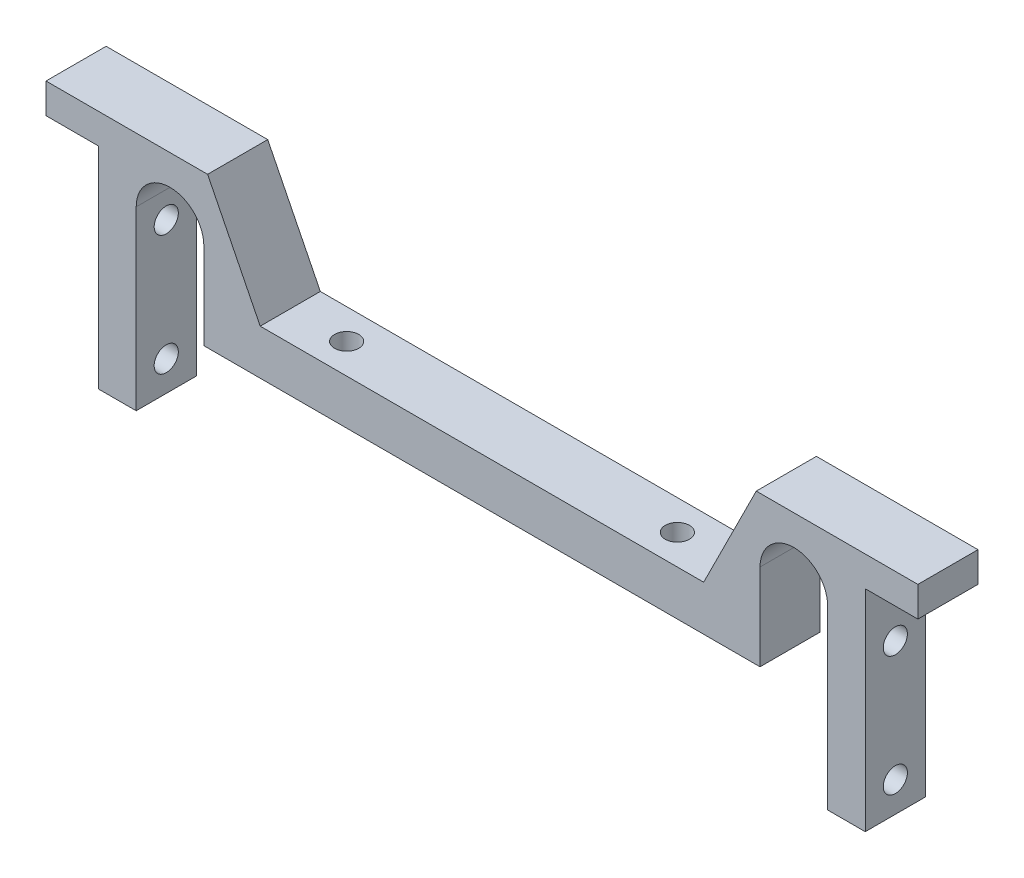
ISO-10303-21;
HEADER;
FILE_DESCRIPTION(('STEP AP214'),'2;1');
FILE_NAME('part.step','',(''),(''),'','','');
FILE_SCHEMA(('AUTOMOTIVE_DESIGN { 1 0 10303 214 1 1 1 1 }'));
ENDSEC;
DATA;
#1=APPLICATION_CONTEXT('core data for automotive mechanical design processes');
#2=APPLICATION_PROTOCOL_DEFINITION('international standard','automotive_design',2000,#1);
#3=PRODUCT_CONTEXT('',#1,'mechanical');
#4=PRODUCT('Part','Part','',(#3));
#5=PRODUCT_RELATED_PRODUCT_CATEGORY('part','',(#4));
#6=PRODUCT_DEFINITION_FORMATION('','',#4);
#7=PRODUCT_DEFINITION_CONTEXT('part definition',#1,'design');
#8=PRODUCT_DEFINITION('design','',#6,#7);
#9=PRODUCT_DEFINITION_SHAPE('','',#8);
#10=(LENGTH_UNIT() NAMED_UNIT(*) SI_UNIT(.MILLI.,.METRE.));
#11=(NAMED_UNIT(*) PLANE_ANGLE_UNIT() SI_UNIT($,.RADIAN.));
#12=(NAMED_UNIT(*) SI_UNIT($,.STERADIAN.) SOLID_ANGLE_UNIT());
#13=UNCERTAINTY_MEASURE_WITH_UNIT(LENGTH_MEASURE(1.E-05),#10,'distance_accuracy_value','');
#14=(GEOMETRIC_REPRESENTATION_CONTEXT(3) GLOBAL_UNCERTAINTY_ASSIGNED_CONTEXT((#13)) GLOBAL_UNIT_ASSIGNED_CONTEXT((#10,
#11,#12)) REPRESENTATION_CONTEXT('',''));
#15=CARTESIAN_POINT('',(0.,0.,0.));
#16=DIRECTION('',(0.,0.,1.));
#17=DIRECTION('',(1.,0.,0.));
#18=AXIS2_PLACEMENT_3D('',#15,#16,#17);
#19=CARTESIAN_POINT('',(-58.7375,0.,6.35));
#20=DIRECTION('',(1.,0.,0.));
#21=DIRECTION('',(0.,1.,0.));
#22=AXIS2_PLACEMENT_3D('',#19,#20,#21);
#23=PLANE('',#22);
#24=DIRECTION('',(0.,-1.,0.));
#25=VECTOR('',#24,1.);
#26=CARTESIAN_POINT('',(-58.7375,0.,-6.35));
#27=LINE('',#26,#25);
#28=CARTESIAN_POINT('',(-58.7375,18.25625,-6.35));
#29=VERTEX_POINT('',#28);
#30=CARTESIAN_POINT('',(-58.7375,0.,-6.35));
#31=VERTEX_POINT('',#30);
#32=EDGE_CURVE('E202',#29,#31,#27,.T.);
#33=ORIENTED_EDGE('',*,*,#32,.T.);
#34=DIRECTION('',(0.,0.,-1.));
#35=VECTOR('',#34,1.);
#36=CARTESIAN_POINT('',(-58.7375,0.,6.35));
#37=LINE('',#36,#35);
#38=CARTESIAN_POINT('',(-58.7375,0.,6.35));
#39=VERTEX_POINT('',#38);
#40=EDGE_CURVE('E11',#39,#31,#37,.T.);
#41=ORIENTED_EDGE('',*,*,#40,.F.);
#42=DIRECTION('',(0.,-1.,0.));
#43=VECTOR('',#42,1.);
#44=CARTESIAN_POINT('',(-58.7375,0.,6.35));
#45=LINE('',#44,#43);
#46=CARTESIAN_POINT('',(-58.7375,18.25625,6.35));
#47=VERTEX_POINT('',#46);
#48=EDGE_CURVE('E241',#47,#39,#45,.T.);
#49=ORIENTED_EDGE('',*,*,#48,.F.);
#50=DIRECTION('',(0.,0.,-1.));
#51=VECTOR('',#50,1.);
#52=CARTESIAN_POINT('',(-58.7375,18.25625,6.35));
#53=LINE('',#52,#51);
#54=EDGE_CURVE('E198',#47,#29,#53,.T.);
#55=ORIENTED_EDGE('',*,*,#54,.T.);
#56=EDGE_LOOP('',(#33,#41,#49,#55));
#57=FACE_BOUND('',#56,.T.);
#58=ADVANCED_FACE('F34',(#57),#23,.F.);
#59=CARTESIAN_POINT('',(-58.7375,0.,6.35));
#60=DIRECTION('',(0.,1.,0.));
#61=DIRECTION('',(-1.,0.,0.));
#62=AXIS2_PLACEMENT_3D('',#59,#60,#61);
#63=PLANE('',#62);
#64=CARTESIAN_POINT('',(-34.925,0.,0.));
#65=DIRECTION('',(0.,1.,0.));
#66=DIRECTION('',(-1.,0.,0.));
#67=AXIS2_PLACEMENT_3D('',#64,#65,#66);
#68=CIRCLE('',#67,2.55269999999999);
#69=CARTESIAN_POINT('',(-37.4777,0.,0.));
#70=VERTEX_POINT('',#69);
#71=EDGE_CURVE('E648',#70,#70,#68,.T.);
#72=ORIENTED_EDGE('',*,*,#71,.T.);
#73=EDGE_LOOP('',(#72));
#74=FACE_BOUND('',#73,.T.);
#75=CARTESIAN_POINT('',(34.925,0.,0.));
#76=DIRECTION('',(0.,1.,0.));
#77=DIRECTION('',(-1.,0.,0.));
#78=AXIS2_PLACEMENT_3D('',#75,#76,#77);
#79=CIRCLE('',#78,2.55269999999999);
#80=CARTESIAN_POINT('',(32.3723,0.,0.));
#81=VERTEX_POINT('',#80);
#82=EDGE_CURVE('E642',#81,#81,#79,.T.);
#83=ORIENTED_EDGE('',*,*,#82,.T.);
#84=EDGE_LOOP('',(#83));
#85=FACE_BOUND('',#84,.T.);
#86=DIRECTION('',(1.,0.,0.));
#87=VECTOR('',#86,1.);
#88=CARTESIAN_POINT('',(-58.7375,0.,-6.35));
#89=LINE('',#88,#87);
#90=CARTESIAN_POINT('',(58.7375,0.,-6.35));
#91=VERTEX_POINT('',#90);
#92=EDGE_CURVE('E205',#31,#91,#89,.T.);
#93=ORIENTED_EDGE('',*,*,#92,.T.);
#94=DIRECTION('',(0.,0.,-1.));
#95=VECTOR('',#94,1.);
#96=CARTESIAN_POINT('',(58.7375,0.,6.35));
#97=LINE('',#96,#95);
#98=CARTESIAN_POINT('',(58.7375,0.,6.35));
#99=VERTEX_POINT('',#98);
#100=EDGE_CURVE('E42',#99,#91,#97,.T.);
#101=ORIENTED_EDGE('',*,*,#100,.F.);
#102=DIRECTION('',(1.,0.,0.));
#103=VECTOR('',#102,1.);
#104=CARTESIAN_POINT('',(-58.7375,0.,6.35));
#105=LINE('',#104,#103);
#106=EDGE_CURVE('E129',#39,#99,#105,.T.);
#107=ORIENTED_EDGE('',*,*,#106,.F.);
#108=ORIENTED_EDGE('',*,*,#40,.T.);
#109=EDGE_LOOP('',(#93,#101,#107,#108));
#110=FACE_BOUND('',#109,.T.);
#111=ADVANCED_FACE('F360',(#74,#85,#110),#63,.F.);
#112=CARTESIAN_POINT('',(58.7375,0.,6.35));
#113=DIRECTION('',(-1.,0.,0.));
#114=DIRECTION('',(0.,-1.,0.));
#115=AXIS2_PLACEMENT_3D('',#112,#113,#114);
#116=PLANE('',#115);
#117=DIRECTION('',(0.,1.,0.));
#118=VECTOR('',#117,1.);
#119=CARTESIAN_POINT('',(58.7375,0.,-6.35));
#120=LINE('',#119,#118);
#121=CARTESIAN_POINT('',(58.7375,18.25625,-6.35));
#122=VERTEX_POINT('',#121);
#123=EDGE_CURVE('E208',#91,#122,#120,.T.);
#124=ORIENTED_EDGE('',*,*,#123,.T.);
#125=DIRECTION('',(0.,0.,-1.));
#126=VECTOR('',#125,1.);
#127=CARTESIAN_POINT('',(58.7375,18.25625,6.35));
#128=LINE('',#127,#126);
#129=CARTESIAN_POINT('',(58.7375,18.25625,6.35));
#130=VERTEX_POINT('',#129);
#131=EDGE_CURVE('E284',#130,#122,#128,.T.);
#132=ORIENTED_EDGE('',*,*,#131,.F.);
#133=DIRECTION('',(0.,1.,0.));
#134=VECTOR('',#133,1.);
#135=CARTESIAN_POINT('',(58.7375,0.,6.35));
#136=LINE('',#135,#134);
#137=EDGE_CURVE('E292',#99,#130,#136,.T.);
#138=ORIENTED_EDGE('',*,*,#137,.F.);
#139=ORIENTED_EDGE('',*,*,#100,.T.);
#140=EDGE_LOOP('',(#124,#132,#138,#139));
#141=FACE_BOUND('',#140,.T.);
#142=ADVANCED_FACE('F290',(#141),#116,.F.);
#143=CARTESIAN_POINT('',(65.88125,18.25625,6.35));
#144=DIRECTION('',(0.,0.,-1.));
#145=DIRECTION('',(-1.,0.,0.));
#146=AXIS2_PLACEMENT_3D('',#143,#144,#145);
#147=CYLINDRICAL_SURFACE('',#146,7.14375);
#148=CARTESIAN_POINT('',(65.88125,18.25625,-6.35));
#149=DIRECTION('',(0.,0.,-1.));
#150=DIRECTION('',(-1.,0.,0.));
#151=AXIS2_PLACEMENT_3D('',#148,#149,#150);
#152=CIRCLE('',#151,7.14375);
#153=CARTESIAN_POINT('',(73.025,18.25625,-6.35));
#154=VERTEX_POINT('',#153);
#155=EDGE_CURVE('E210',#122,#154,#152,.T.);
#156=ORIENTED_EDGE('',*,*,#155,.T.);
#157=DIRECTION('',(0.,0.,-1.));
#158=VECTOR('',#157,1.);
#159=CARTESIAN_POINT('',(73.025,18.25625,6.35));
#160=LINE('',#159,#158);
#161=CARTESIAN_POINT('',(73.025,18.25625,6.35));
#162=VERTEX_POINT('',#161);
#163=EDGE_CURVE('E281',#162,#154,#160,.T.);
#164=ORIENTED_EDGE('',*,*,#163,.F.);
#165=CARTESIAN_POINT('',(65.88125,18.25625,6.35));
#166=DIRECTION('',(0.,0.,-1.));
#167=DIRECTION('',(-1.,0.,0.));
#168=AXIS2_PLACEMENT_3D('',#165,#166,#167);
#169=CIRCLE('',#168,7.14375);
#170=EDGE_CURVE('E310',#130,#162,#169,.T.);
#171=ORIENTED_EDGE('',*,*,#170,.F.);
#172=ORIENTED_EDGE('',*,*,#131,.T.);
#173=EDGE_LOOP('',(#156,#164,#171,#172));
#174=FACE_BOUND('',#173,.T.);
#175=ADVANCED_FACE('F301',(#174),#147,.F.);
#176=CARTESIAN_POINT('',(73.025,18.25625,6.35));
#177=DIRECTION('',(1.,0.,0.));
#178=DIRECTION('',(0.,0.,-1.));
#179=AXIS2_PLACEMENT_3D('',#176,#177,#178);
#180=PLANE('',#179);
#181=CARTESIAN_POINT('',(73.025,12.7000000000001,0.));
#182=DIRECTION('',(1.,0.,0.));
#183=DIRECTION('',(0.,0.,-1.));
#184=AXIS2_PLACEMENT_3D('',#181,#182,#183);
#185=CIRCLE('',#184,2.55269999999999);
#186=CARTESIAN_POINT('',(73.025,12.7000000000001,-2.55269999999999));
#187=VERTEX_POINT('',#186);
#188=EDGE_CURVE('E619',#187,#187,#185,.T.);
#189=ORIENTED_EDGE('',*,*,#188,.T.);
#190=EDGE_LOOP('',(#189));
#191=FACE_BOUND('',#190,.T.);
#192=CARTESIAN_POINT('',(73.025,-12.6999999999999,0.));
#193=DIRECTION('',(1.,0.,0.));
#194=DIRECTION('',(0.,0.,-1.));
#195=AXIS2_PLACEMENT_3D('',#192,#193,#194);
#196=CIRCLE('',#195,2.55269999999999);
#197=CARTESIAN_POINT('',(73.025,-12.6999999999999,-2.55269999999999));
#198=VERTEX_POINT('',#197);
#199=EDGE_CURVE('E206',#198,#198,#196,.T.);
#200=ORIENTED_EDGE('',*,*,#199,.T.);
#201=EDGE_LOOP('',(#200));
#202=FACE_BOUND('',#201,.T.);
#203=DIRECTION('',(0.,-1.,0.));
#204=VECTOR('',#203,1.);
#205=CARTESIAN_POINT('',(73.025,18.25625,-6.35));
#206=LINE('',#205,#204);
#207=CARTESIAN_POINT('',(73.025,-19.05,-6.35));
#208=VERTEX_POINT('',#207);
#209=EDGE_CURVE('E212',#154,#208,#206,.T.);
#210=ORIENTED_EDGE('',*,*,#209,.T.);
#211=DIRECTION('',(0.,0.,-1.));
#212=VECTOR('',#211,1.);
#213=CARTESIAN_POINT('',(73.025,-19.05,6.35));
#214=LINE('',#213,#212);
#215=CARTESIAN_POINT('',(73.025,-19.05,6.35));
#216=VERTEX_POINT('',#215);
#217=EDGE_CURVE('E278',#216,#208,#214,.T.);
#218=ORIENTED_EDGE('',*,*,#217,.F.);
#219=DIRECTION('',(0.,-1.,0.));
#220=VECTOR('',#219,1.);
#221=CARTESIAN_POINT('',(73.025,18.25625,6.35));
#222=LINE('',#221,#220);
#223=EDGE_CURVE('E307',#162,#216,#222,.T.);
#224=ORIENTED_EDGE('',*,*,#223,.F.);
#225=ORIENTED_EDGE('',*,*,#163,.T.);
#226=EDGE_LOOP('',(#210,#218,#224,#225));
#227=FACE_BOUND('',#226,.T.);
#228=ADVANCED_FACE('F305',(#191,#202,#227),#180,.F.);
#229=CARTESIAN_POINT('',(73.025,-19.05,6.35));
#230=DIRECTION('',(0.,1.,0.));
#231=DIRECTION('',(0.,0.,1.));
#232=AXIS2_PLACEMENT_3D('',#229,#230,#231);
#233=PLANE('',#232);
#234=DIRECTION('',(1.,0.,0.));
#235=VECTOR('',#234,1.);
#236=CARTESIAN_POINT('',(73.025,-19.05,-6.35));
#237=LINE('',#236,#235);
#238=CARTESIAN_POINT('',(80.9625,-19.05,-6.35));
#239=VERTEX_POINT('',#238);
#240=EDGE_CURVE('E214',#208,#239,#237,.T.);
#241=ORIENTED_EDGE('',*,*,#240,.T.);
#242=DIRECTION('',(0.,0.,-1.));
#243=VECTOR('',#242,1.);
#244=CARTESIAN_POINT('',(80.9625,-19.05,6.35));
#245=LINE('',#244,#243);
#246=CARTESIAN_POINT('',(80.9625,-19.05,6.35));
#247=VERTEX_POINT('',#246);
#248=EDGE_CURVE('E275',#247,#239,#245,.T.);
#249=ORIENTED_EDGE('',*,*,#248,.F.);
#250=DIRECTION('',(1.,0.,0.));
#251=VECTOR('',#250,1.);
#252=CARTESIAN_POINT('',(73.025,-19.05,6.35));
#253=LINE('',#252,#251);
#254=EDGE_CURVE('E309',#216,#247,#253,.T.);
#255=ORIENTED_EDGE('',*,*,#254,.F.);
#256=ORIENTED_EDGE('',*,*,#217,.T.);
#257=EDGE_LOOP('',(#241,#249,#255,#256));
#258=FACE_BOUND('',#257,.T.);
#259=ADVANCED_FACE('F376',(#258),#233,.F.);
#260=CARTESIAN_POINT('',(80.9625,-19.05,6.35));
#261=DIRECTION('',(-1.,0.,0.));
#262=DIRECTION('',(0.,-1.,0.));
#263=AXIS2_PLACEMENT_3D('',#260,#261,#262);
#264=PLANE('',#263);
#265=CARTESIAN_POINT('',(80.9625,12.7000000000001,0.));
#266=DIRECTION('',(1.,0.,0.));
#267=DIRECTION('',(0.,0.,-1.));
#268=AXIS2_PLACEMENT_3D('',#265,#266,#267);
#269=CIRCLE('',#268,2.55269999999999);
#270=CARTESIAN_POINT('',(80.9625,12.7000000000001,-2.55269999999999));
#271=VERTEX_POINT('',#270);
#272=EDGE_CURVE('E623',#271,#271,#269,.T.);
#273=ORIENTED_EDGE('',*,*,#272,.F.);
#274=EDGE_LOOP('',(#273));
#275=FACE_BOUND('',#274,.T.);
#276=CARTESIAN_POINT('',(80.9625,-12.6999999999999,0.));
#277=DIRECTION('',(1.,0.,0.));
#278=DIRECTION('',(0.,0.,-1.));
#279=AXIS2_PLACEMENT_3D('',#276,#277,#278);
#280=CIRCLE('',#279,2.55269999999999);
#281=CARTESIAN_POINT('',(80.9625,-12.6999999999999,-2.55269999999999));
#282=VERTEX_POINT('',#281);
#283=EDGE_CURVE('E617',#282,#282,#280,.T.);
#284=ORIENTED_EDGE('',*,*,#283,.F.);
#285=EDGE_LOOP('',(#284));
#286=FACE_BOUND('',#285,.T.);
#287=DIRECTION('',(0.,1.,0.));
#288=VECTOR('',#287,1.);
#289=CARTESIAN_POINT('',(80.9625,-19.05,-6.35));
#290=LINE('',#289,#288);
#291=CARTESIAN_POINT('',(80.9625,25.4,-6.35));
#292=VERTEX_POINT('',#291);
#293=EDGE_CURVE('E216',#239,#292,#290,.T.);
#294=ORIENTED_EDGE('',*,*,#293,.T.);
#295=DIRECTION('',(0.,0.,-1.));
#296=VECTOR('',#295,1.);
#297=CARTESIAN_POINT('',(80.9625,25.4,6.35));
#298=LINE('',#297,#296);
#299=CARTESIAN_POINT('',(80.9625,25.4,6.35));
#300=VERTEX_POINT('',#299);
#301=EDGE_CURVE('E272',#300,#292,#298,.T.);
#302=ORIENTED_EDGE('',*,*,#301,.F.);
#303=DIRECTION('',(0.,1.,0.));
#304=VECTOR('',#303,1.);
#305=CARTESIAN_POINT('',(80.9625,-19.05,6.35));
#306=LINE('',#305,#304);
#307=EDGE_CURVE('E312',#247,#300,#306,.T.);
#308=ORIENTED_EDGE('',*,*,#307,.F.);
#309=ORIENTED_EDGE('',*,*,#248,.T.);
#310=EDGE_LOOP('',(#294,#302,#308,#309));
#311=FACE_BOUND('',#310,.T.);
#312=ADVANCED_FACE('F380',(#275,#286,#311),#264,.F.);
#313=CARTESIAN_POINT('',(80.9625,25.4,6.35));
#314=DIRECTION('',(0.,1.,0.));
#315=DIRECTION('',(0.,0.,1.));
#316=AXIS2_PLACEMENT_3D('',#313,#314,#315);
#317=PLANE('',#316);
#318=DIRECTION('',(1.,0.,0.));
#319=VECTOR('',#318,1.);
#320=CARTESIAN_POINT('',(80.9625,25.4,-6.35));
#321=LINE('',#320,#319);
#322=CARTESIAN_POINT('',(92.075,25.4,-6.35));
#323=VERTEX_POINT('',#322);
#324=EDGE_CURVE('E218',#292,#323,#321,.T.);
#325=ORIENTED_EDGE('',*,*,#324,.T.);
#326=DIRECTION('',(0.,0.,-1.));
#327=VECTOR('',#326,1.);
#328=CARTESIAN_POINT('',(92.075,25.4,6.35));
#329=LINE('',#328,#327);
#330=CARTESIAN_POINT('',(92.075,25.4,6.35));
#331=VERTEX_POINT('',#330);
#332=EDGE_CURVE('E269',#331,#323,#329,.T.);
#333=ORIENTED_EDGE('',*,*,#332,.F.);
#334=DIRECTION('',(1.,0.,0.));
#335=VECTOR('',#334,1.);
#336=CARTESIAN_POINT('',(80.9625,25.4,6.35));
#337=LINE('',#336,#335);
#338=EDGE_CURVE('E318',#300,#331,#337,.T.);
#339=ORIENTED_EDGE('',*,*,#338,.F.);
#340=ORIENTED_EDGE('',*,*,#301,.T.);
#341=EDGE_LOOP('',(#325,#333,#339,#340));
#342=FACE_BOUND('',#341,.T.);
#343=ADVANCED_FACE('F384',(#342),#317,.F.);
#344=CARTESIAN_POINT('',(92.075,25.4,6.35));
#345=DIRECTION('',(-1.,0.,0.));
#346=DIRECTION('',(0.,-1.,0.));
#347=AXIS2_PLACEMENT_3D('',#344,#345,#346);
#348=PLANE('',#347);
#349=DIRECTION('',(0.,1.,0.));
#350=VECTOR('',#349,1.);
#351=CARTESIAN_POINT('',(92.075,25.4,-6.35));
#352=LINE('',#351,#350);
#353=CARTESIAN_POINT('',(92.075,31.75,-6.35));
#354=VERTEX_POINT('',#353);
#355=EDGE_CURVE('E220',#323,#354,#352,.T.);
#356=ORIENTED_EDGE('',*,*,#355,.T.);
#357=DIRECTION('',(0.,0.,-1.));
#358=VECTOR('',#357,1.);
#359=CARTESIAN_POINT('',(92.075,31.75,6.35));
#360=LINE('',#359,#358);
#361=CARTESIAN_POINT('',(92.075,31.75,6.35));
#362=VERTEX_POINT('',#361);
#363=EDGE_CURVE('E266',#362,#354,#360,.T.);
#364=ORIENTED_EDGE('',*,*,#363,.F.);
#365=DIRECTION('',(0.,1.,0.));
#366=VECTOR('',#365,1.);
#367=CARTESIAN_POINT('',(92.075,25.4,6.35));
#368=LINE('',#367,#366);
#369=EDGE_CURVE('E320',#331,#362,#368,.T.);
#370=ORIENTED_EDGE('',*,*,#369,.F.);
#371=ORIENTED_EDGE('',*,*,#332,.T.);
#372=EDGE_LOOP('',(#356,#364,#370,#371));
#373=FACE_BOUND('',#372,.T.);
#374=ADVANCED_FACE('F388',(#373),#348,.F.);
#375=CARTESIAN_POINT('',(57.94375,31.75,6.35));
#376=DIRECTION('',(0.,-1.,0.));
#377=DIRECTION('',(1.,0.,0.));
#378=AXIS2_PLACEMENT_3D('',#375,#376,#377);
#379=PLANE('',#378);
#380=DIRECTION('',(-1.,0.,0.));
#381=VECTOR('',#380,1.);
#382=CARTESIAN_POINT('',(57.94375,31.75,-6.35));
#383=LINE('',#382,#381);
#384=CARTESIAN_POINT('',(57.94375,31.75,-6.35));
#385=VERTEX_POINT('',#384);
#386=EDGE_CURVE('E222',#354,#385,#383,.T.);
#387=ORIENTED_EDGE('',*,*,#386,.T.);
#388=DIRECTION('',(0.,0.,-1.));
#389=VECTOR('',#388,1.);
#390=CARTESIAN_POINT('',(57.94375,31.75,6.35));
#391=LINE('',#390,#389);
#392=CARTESIAN_POINT('',(57.94375,31.75,6.35));
#393=VERTEX_POINT('',#392);
#394=EDGE_CURVE('E263',#393,#385,#391,.T.);
#395=ORIENTED_EDGE('',*,*,#394,.F.);
#396=DIRECTION('',(-1.,0.,0.));
#397=VECTOR('',#396,1.);
#398=CARTESIAN_POINT('',(57.94375,31.75,6.35));
#399=LINE('',#398,#397);
#400=EDGE_CURVE('E322',#362,#393,#399,.T.);
#401=ORIENTED_EDGE('',*,*,#400,.F.);
#402=ORIENTED_EDGE('',*,*,#363,.T.);
#403=EDGE_LOOP('',(#387,#395,#401,#402));
#404=FACE_BOUND('',#403,.T.);
#405=ADVANCED_FACE('F392',(#404),#379,.F.);
#406=CARTESIAN_POINT('',(46.83125,9.52500000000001,6.35));
#407=DIRECTION('',(0.894427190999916,-0.447213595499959,0.));
#408=DIRECTION('',(0.447213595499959,0.894427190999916,0.));
#409=AXIS2_PLACEMENT_3D('',#406,#407,#408);
#410=PLANE('',#409);
#411=DIRECTION('',(-0.447213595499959,-0.894427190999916,0.));
#412=VECTOR('',#411,1.);
#413=CARTESIAN_POINT('',(46.83125,9.52500000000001,-6.35));
#414=LINE('',#413,#412);
#415=CARTESIAN_POINT('',(46.83125,9.52500000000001,-6.35));
#416=VERTEX_POINT('',#415);
#417=EDGE_CURVE('E224',#385,#416,#414,.T.);
#418=ORIENTED_EDGE('',*,*,#417,.T.);
#419=DIRECTION('',(0.,0.,-1.));
#420=VECTOR('',#419,1.);
#421=CARTESIAN_POINT('',(46.83125,9.52500000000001,6.35));
#422=LINE('',#421,#420);
#423=CARTESIAN_POINT('',(46.83125,9.52500000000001,6.35));
#424=VERTEX_POINT('',#423);
#425=EDGE_CURVE('E260',#424,#416,#422,.T.);
#426=ORIENTED_EDGE('',*,*,#425,.F.);
#427=DIRECTION('',(-0.447213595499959,-0.894427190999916,0.));
#428=VECTOR('',#427,1.);
#429=CARTESIAN_POINT('',(46.83125,9.52500000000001,6.35));
#430=LINE('',#429,#428);
#431=EDGE_CURVE('E324',#393,#424,#430,.T.);
#432=ORIENTED_EDGE('',*,*,#431,.F.);
#433=ORIENTED_EDGE('',*,*,#394,.T.);
#434=EDGE_LOOP('',(#418,#426,#432,#433));
#435=FACE_BOUND('',#434,.T.);
#436=ADVANCED_FACE('F396',(#435),#410,.F.);
#437=CARTESIAN_POINT('',(-46.83125,9.525,6.35));
#438=DIRECTION('',(0.,-1.,0.));
#439=DIRECTION('',(1.,0.,0.));
#440=AXIS2_PLACEMENT_3D('',#437,#438,#439);
#441=PLANE('',#440);
#442=CARTESIAN_POINT('',(-34.925,9.52500000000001,0.));
#443=DIRECTION('',(0.,1.,0.));
#444=DIRECTION('',(0.,0.,1.));
#445=AXIS2_PLACEMENT_3D('',#442,#443,#444);
#446=CIRCLE('',#445,2.55269999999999);
#447=CARTESIAN_POINT('',(-34.925,9.52500000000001,2.55269999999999));
#448=VERTEX_POINT('',#447);
#449=EDGE_CURVE('E650',#448,#448,#446,.T.);
#450=ORIENTED_EDGE('',*,*,#449,.F.);
#451=EDGE_LOOP('',(#450));
#452=FACE_BOUND('',#451,.T.);
#453=CARTESIAN_POINT('',(34.925,9.52500000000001,0.));
#454=DIRECTION('',(0.,1.,0.));
#455=DIRECTION('',(0.,0.,1.));
#456=AXIS2_PLACEMENT_3D('',#453,#454,#455);
#457=CIRCLE('',#456,2.55269999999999);
#458=CARTESIAN_POINT('',(34.925,9.52500000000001,2.55269999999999));
#459=VERTEX_POINT('',#458);
#460=EDGE_CURVE('E645',#459,#459,#457,.T.);
#461=ORIENTED_EDGE('',*,*,#460,.F.);
#462=EDGE_LOOP('',(#461));
#463=FACE_BOUND('',#462,.T.);
#464=DIRECTION('',(-1.,0.,0.));
#465=VECTOR('',#464,1.);
#466=CARTESIAN_POINT('',(-46.83125,9.525,-6.35));
#467=LINE('',#466,#465);
#468=CARTESIAN_POINT('',(-46.83125,9.525,-6.35));
#469=VERTEX_POINT('',#468);
#470=EDGE_CURVE('E226',#416,#469,#467,.T.);
#471=ORIENTED_EDGE('',*,*,#470,.T.);
#472=DIRECTION('',(0.,0.,-1.));
#473=VECTOR('',#472,1.);
#474=CARTESIAN_POINT('',(-46.83125,9.525,6.35));
#475=LINE('',#474,#473);
#476=CARTESIAN_POINT('',(-46.83125,9.525,6.35));
#477=VERTEX_POINT('',#476);
#478=EDGE_CURVE('E257',#477,#469,#475,.T.);
#479=ORIENTED_EDGE('',*,*,#478,.F.);
#480=DIRECTION('',(-1.,0.,0.));
#481=VECTOR('',#480,1.);
#482=CARTESIAN_POINT('',(-46.83125,9.525,6.35));
#483=LINE('',#482,#481);
#484=EDGE_CURVE('E326',#424,#477,#483,.T.);
#485=ORIENTED_EDGE('',*,*,#484,.F.);
#486=ORIENTED_EDGE('',*,*,#425,.T.);
#487=EDGE_LOOP('',(#471,#479,#485,#486));
#488=FACE_BOUND('',#487,.T.);
#489=ADVANCED_FACE('F400',(#452,#463,#488),#441,.F.);
#490=CARTESIAN_POINT('',(-57.94375,31.75,6.35));
#491=DIRECTION('',(-0.894427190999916,-0.447213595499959,0.));
#492=DIRECTION('',(0.447213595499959,-0.894427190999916,0.));
#493=AXIS2_PLACEMENT_3D('',#490,#491,#492);
#494=PLANE('',#493);
#495=DIRECTION('',(-0.447213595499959,0.894427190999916,0.));
#496=VECTOR('',#495,1.);
#497=CARTESIAN_POINT('',(-57.94375,31.75,-6.35));
#498=LINE('',#497,#496);
#499=CARTESIAN_POINT('',(-57.94375,31.75,-6.35));
#500=VERTEX_POINT('',#499);
#501=EDGE_CURVE('E228',#469,#500,#498,.T.);
#502=ORIENTED_EDGE('',*,*,#501,.T.);
#503=DIRECTION('',(0.,0.,-1.));
#504=VECTOR('',#503,1.);
#505=CARTESIAN_POINT('',(-57.94375,31.75,6.35));
#506=LINE('',#505,#504);
#507=CARTESIAN_POINT('',(-57.94375,31.75,6.35));
#508=VERTEX_POINT('',#507);
#509=EDGE_CURVE('E254',#508,#500,#506,.T.);
#510=ORIENTED_EDGE('',*,*,#509,.F.);
#511=DIRECTION('',(-0.447213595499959,0.894427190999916,0.));
#512=VECTOR('',#511,1.);
#513=CARTESIAN_POINT('',(-57.94375,31.75,6.35));
#514=LINE('',#513,#512);
#515=EDGE_CURVE('E328',#477,#508,#514,.T.);
#516=ORIENTED_EDGE('',*,*,#515,.F.);
#517=ORIENTED_EDGE('',*,*,#478,.T.);
#518=EDGE_LOOP('',(#502,#510,#516,#517));
#519=FACE_BOUND('',#518,.T.);
#520=ADVANCED_FACE('F404',(#519),#494,.F.);
#521=CARTESIAN_POINT('',(-92.075,31.75,6.35));
#522=DIRECTION('',(0.,-1.,0.));
#523=DIRECTION('',(0.,0.,-1.));
#524=AXIS2_PLACEMENT_3D('',#521,#522,#523);
#525=PLANE('',#524);
#526=DIRECTION('',(-1.,0.,0.));
#527=VECTOR('',#526,1.);
#528=CARTESIAN_POINT('',(-92.075,31.75,-6.35));
#529=LINE('',#528,#527);
#530=CARTESIAN_POINT('',(-92.075,31.75,-6.35));
#531=VERTEX_POINT('',#530);
#532=EDGE_CURVE('E230',#500,#531,#529,.T.);
#533=ORIENTED_EDGE('',*,*,#532,.T.);
#534=DIRECTION('',(0.,0.,-1.));
#535=VECTOR('',#534,1.);
#536=CARTESIAN_POINT('',(-92.075,31.75,6.35));
#537=LINE('',#536,#535);
#538=CARTESIAN_POINT('',(-92.075,31.75,6.35));
#539=VERTEX_POINT('',#538);
#540=EDGE_CURVE('E251',#539,#531,#537,.T.);
#541=ORIENTED_EDGE('',*,*,#540,.F.);
#542=DIRECTION('',(-1.,0.,0.));
#543=VECTOR('',#542,1.);
#544=CARTESIAN_POINT('',(-92.075,31.75,6.35));
#545=LINE('',#544,#543);
#546=EDGE_CURVE('E330',#508,#539,#545,.T.);
#547=ORIENTED_EDGE('',*,*,#546,.F.);
#548=ORIENTED_EDGE('',*,*,#509,.T.);
#549=EDGE_LOOP('',(#533,#541,#547,#548));
#550=FACE_BOUND('',#549,.T.);
#551=ADVANCED_FACE('F408',(#550),#525,.F.);
#552=CARTESIAN_POINT('',(-92.075,25.4,6.35));
#553=DIRECTION('',(1.,0.,0.));
#554=DIRECTION('',(0.,0.,-1.));
#555=AXIS2_PLACEMENT_3D('',#552,#553,#554);
#556=PLANE('',#555);
#557=DIRECTION('',(0.,-1.,0.));
#558=VECTOR('',#557,1.);
#559=CARTESIAN_POINT('',(-92.075,25.4,-6.35));
#560=LINE('',#559,#558);
#561=CARTESIAN_POINT('',(-92.075,25.4,-6.35));
#562=VERTEX_POINT('',#561);
#563=EDGE_CURVE('E232',#531,#562,#560,.T.);
#564=ORIENTED_EDGE('',*,*,#563,.T.);
#565=DIRECTION('',(0.,0.,-1.));
#566=VECTOR('',#565,1.);
#567=CARTESIAN_POINT('',(-92.075,25.4,6.35));
#568=LINE('',#567,#566);
#569=CARTESIAN_POINT('',(-92.075,25.4,6.35));
#570=VERTEX_POINT('',#569);
#571=EDGE_CURVE('E248',#570,#562,#568,.T.);
#572=ORIENTED_EDGE('',*,*,#571,.F.);
#573=DIRECTION('',(0.,-1.,0.));
#574=VECTOR('',#573,1.);
#575=CARTESIAN_POINT('',(-92.075,25.4,6.35));
#576=LINE('',#575,#574);
#577=EDGE_CURVE('E332',#539,#570,#576,.T.);
#578=ORIENTED_EDGE('',*,*,#577,.F.);
#579=ORIENTED_EDGE('',*,*,#540,.T.);
#580=EDGE_LOOP('',(#564,#572,#578,#579));
#581=FACE_BOUND('',#580,.T.);
#582=ADVANCED_FACE('F412',(#581),#556,.F.);
#583=CARTESIAN_POINT('',(-92.075,25.4,6.35));
#584=DIRECTION('',(0.,1.,0.));
#585=DIRECTION('',(0.,0.,1.));
#586=AXIS2_PLACEMENT_3D('',#583,#584,#585);
#587=PLANE('',#586);
#588=DIRECTION('',(1.,0.,0.));
#589=VECTOR('',#588,1.);
#590=CARTESIAN_POINT('',(-92.075,25.4,-6.35));
#591=LINE('',#590,#589);
#592=CARTESIAN_POINT('',(-80.9625,25.4,-6.35));
#593=VERTEX_POINT('',#592);
#594=EDGE_CURVE('E234',#562,#593,#591,.T.);
#595=ORIENTED_EDGE('',*,*,#594,.T.);
#596=DIRECTION('',(0.,0.,-1.));
#597=VECTOR('',#596,1.);
#598=CARTESIAN_POINT('',(-80.9625,25.4,6.35));
#599=LINE('',#598,#597);
#600=CARTESIAN_POINT('',(-80.9625,25.4,6.35));
#601=VERTEX_POINT('',#600);
#602=EDGE_CURVE('E245',#601,#593,#599,.T.);
#603=ORIENTED_EDGE('',*,*,#602,.F.);
#604=DIRECTION('',(1.,0.,0.));
#605=VECTOR('',#604,1.);
#606=CARTESIAN_POINT('',(-92.075,25.4,6.35));
#607=LINE('',#606,#605);
#608=EDGE_CURVE('E334',#570,#601,#607,.T.);
#609=ORIENTED_EDGE('',*,*,#608,.F.);
#610=ORIENTED_EDGE('',*,*,#571,.T.);
#611=EDGE_LOOP('',(#595,#603,#609,#610));
#612=FACE_BOUND('',#611,.T.);
#613=ADVANCED_FACE('F340',(#612),#587,.F.);
#614=CARTESIAN_POINT('',(-80.9625,-19.05,6.35));
#615=DIRECTION('',(1.,0.,0.));
#616=DIRECTION('',(0.,1.,0.));
#617=AXIS2_PLACEMENT_3D('',#614,#615,#616);
#618=PLANE('',#617);
#619=CARTESIAN_POINT('',(-80.9625,12.7000000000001,0.));
#620=DIRECTION('',(-1.,0.,0.));
#621=DIRECTION('',(0.,0.,1.));
#622=AXIS2_PLACEMENT_3D('',#619,#620,#621);
#623=CIRCLE('',#622,2.55269999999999);
#624=CARTESIAN_POINT('',(-80.9625,12.7000000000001,2.55269999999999));
#625=VERTEX_POINT('',#624);
#626=EDGE_CURVE('E639',#625,#625,#623,.T.);
#627=ORIENTED_EDGE('',*,*,#626,.F.);
#628=EDGE_LOOP('',(#627));
#629=FACE_BOUND('',#628,.T.);
#630=CARTESIAN_POINT('',(-80.9625,-12.6999999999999,0.));
#631=DIRECTION('',(-1.,0.,0.));
#632=DIRECTION('',(0.,0.,1.));
#633=AXIS2_PLACEMENT_3D('',#630,#631,#632);
#634=CIRCLE('',#633,2.55269999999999);
#635=CARTESIAN_POINT('',(-80.9625,-12.6999999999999,2.55269999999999));
#636=VERTEX_POINT('',#635);
#637=EDGE_CURVE('E633',#636,#636,#634,.T.);
#638=ORIENTED_EDGE('',*,*,#637,.F.);
#639=EDGE_LOOP('',(#638));
#640=FACE_BOUND('',#639,.T.);
#641=DIRECTION('',(0.,-1.,0.));
#642=VECTOR('',#641,1.);
#643=CARTESIAN_POINT('',(-80.9625,-19.05,-6.35));
#644=LINE('',#643,#642);
#645=CARTESIAN_POINT('',(-80.9625,-19.05,-6.35));
#646=VERTEX_POINT('',#645);
#647=EDGE_CURVE('E236',#593,#646,#644,.T.);
#648=ORIENTED_EDGE('',*,*,#647,.T.);
#649=DIRECTION('',(0.,0.,-1.));
#650=VECTOR('',#649,1.);
#651=CARTESIAN_POINT('',(-80.9625,-19.05,6.35));
#652=LINE('',#651,#650);
#653=CARTESIAN_POINT('',(-80.9625,-19.05,6.35));
#654=VERTEX_POINT('',#653);
#655=EDGE_CURVE('E193',#654,#646,#652,.T.);
#656=ORIENTED_EDGE('',*,*,#655,.F.);
#657=DIRECTION('',(0.,-1.,0.));
#658=VECTOR('',#657,1.);
#659=CARTESIAN_POINT('',(-80.9625,-19.05,6.35));
#660=LINE('',#659,#658);
#661=EDGE_CURVE('E184',#601,#654,#660,.T.);
#662=ORIENTED_EDGE('',*,*,#661,.F.);
#663=ORIENTED_EDGE('',*,*,#602,.T.);
#664=EDGE_LOOP('',(#648,#656,#662,#663));
#665=FACE_BOUND('',#664,.T.);
#666=ADVANCED_FACE('F344',(#629,#640,#665),#618,.F.);
#667=CARTESIAN_POINT('',(-73.025,-19.05,6.35));
#668=DIRECTION('',(0.,1.,0.));
#669=DIRECTION('',(-1.,0.,0.));
#670=AXIS2_PLACEMENT_3D('',#667,#668,#669);
#671=PLANE('',#670);
#672=DIRECTION('',(1.,0.,0.));
#673=VECTOR('',#672,1.);
#674=CARTESIAN_POINT('',(-73.025,-19.05,-6.35));
#675=LINE('',#674,#673);
#676=CARTESIAN_POINT('',(-73.025,-19.05,-6.35));
#677=VERTEX_POINT('',#676);
#678=EDGE_CURVE('E192',#646,#677,#675,.T.);
#679=ORIENTED_EDGE('',*,*,#678,.T.);
#680=DIRECTION('',(0.,0.,-1.));
#681=VECTOR('',#680,1.);
#682=CARTESIAN_POINT('',(-73.025,-19.05,6.35));
#683=LINE('',#682,#681);
#684=CARTESIAN_POINT('',(-73.025,-19.05,6.35));
#685=VERTEX_POINT('',#684);
#686=EDGE_CURVE('E189',#685,#677,#683,.T.);
#687=ORIENTED_EDGE('',*,*,#686,.F.);
#688=DIRECTION('',(1.,0.,0.));
#689=VECTOR('',#688,1.);
#690=CARTESIAN_POINT('',(-73.025,-19.05,6.35));
#691=LINE('',#690,#689);
#692=EDGE_CURVE('E178',#654,#685,#691,.T.);
#693=ORIENTED_EDGE('',*,*,#692,.F.);
#694=ORIENTED_EDGE('',*,*,#655,.T.);
#695=EDGE_LOOP('',(#679,#687,#693,#694));
#696=FACE_BOUND('',#695,.T.);
#697=ADVANCED_FACE('F190',(#696),#671,.F.);
#698=CARTESIAN_POINT('',(-73.025,18.25625,6.35));
#699=DIRECTION('',(-1.,0.,0.));
#700=DIRECTION('',(0.,0.,1.));
#701=AXIS2_PLACEMENT_3D('',#698,#699,#700);
#702=PLANE('',#701);
#703=CARTESIAN_POINT('',(-73.025,12.7000000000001,0.));
#704=DIRECTION('',(-1.,0.,0.));
#705=DIRECTION('',(0.,0.,1.));
#706=AXIS2_PLACEMENT_3D('',#703,#704,#705);
#707=CIRCLE('',#706,2.55269999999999);
#708=CARTESIAN_POINT('',(-73.025,12.7000000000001,2.55269999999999));
#709=VERTEX_POINT('',#708);
#710=EDGE_CURVE('E636',#709,#709,#707,.T.);
#711=ORIENTED_EDGE('',*,*,#710,.T.);
#712=EDGE_LOOP('',(#711));
#713=FACE_BOUND('',#712,.T.);
#714=CARTESIAN_POINT('',(-73.025,-12.6999999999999,0.));
#715=DIRECTION('',(-1.,0.,0.));
#716=DIRECTION('',(0.,0.,1.));
#717=AXIS2_PLACEMENT_3D('',#714,#715,#716);
#718=CIRCLE('',#717,2.55269999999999);
#719=CARTESIAN_POINT('',(-73.025,-12.6999999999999,2.55269999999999));
#720=VERTEX_POINT('',#719);
#721=EDGE_CURVE('E630',#720,#720,#718,.T.);
#722=ORIENTED_EDGE('',*,*,#721,.T.);
#723=EDGE_LOOP('',(#722));
#724=FACE_BOUND('',#723,.T.);
#725=DIRECTION('',(0.,1.,0.));
#726=VECTOR('',#725,1.);
#727=CARTESIAN_POINT('',(-73.025,18.25625,-6.35));
#728=LINE('',#727,#726);
#729=CARTESIAN_POINT('',(-73.025,18.25625,-6.35));
#730=VERTEX_POINT('',#729);
#731=EDGE_CURVE('E115',#677,#730,#728,.T.);
#732=ORIENTED_EDGE('',*,*,#731,.T.);
#733=DIRECTION('',(0.,0.,-1.));
#734=VECTOR('',#733,1.);
#735=CARTESIAN_POINT('',(-73.025,18.25625,6.35));
#736=LINE('',#735,#734);
#737=CARTESIAN_POINT('',(-73.025,18.25625,6.35));
#738=VERTEX_POINT('',#737);
#739=EDGE_CURVE('E194',#738,#730,#736,.T.);
#740=ORIENTED_EDGE('',*,*,#739,.F.);
#741=DIRECTION('',(0.,1.,0.));
#742=VECTOR('',#741,1.);
#743=CARTESIAN_POINT('',(-73.025,18.25625,6.35));
#744=LINE('',#743,#742);
#745=EDGE_CURVE('E182',#685,#738,#744,.T.);
#746=ORIENTED_EDGE('',*,*,#745,.F.);
#747=ORIENTED_EDGE('',*,*,#686,.T.);
#748=EDGE_LOOP('',(#732,#740,#746,#747));
#749=FACE_BOUND('',#748,.T.);
#750=ADVANCED_FACE('F196',(#713,#724,#749),#702,.F.);
#751=CARTESIAN_POINT('',(-65.88125,18.25625,6.35));
#752=DIRECTION('',(0.,0.,-1.));
#753=DIRECTION('',(-1.,0.,0.));
#754=AXIS2_PLACEMENT_3D('',#751,#752,#753);
#755=CYLINDRICAL_SURFACE('',#754,7.14375);
#756=CARTESIAN_POINT('',(-65.88125,18.25625,-6.35));
#757=DIRECTION('',(0.,0.,-1.));
#758=DIRECTION('',(1.,0.,0.));
#759=AXIS2_PLACEMENT_3D('',#756,#757,#758);
#760=CIRCLE('',#759,7.14375);
#761=EDGE_CURVE('E121',#730,#29,#760,.T.);
#762=ORIENTED_EDGE('',*,*,#761,.T.);
#763=ORIENTED_EDGE('',*,*,#54,.F.);
#764=CARTESIAN_POINT('',(-65.88125,18.25625,6.35));
#765=DIRECTION('',(0.,0.,-1.));
#766=DIRECTION('',(1.,0.,0.));
#767=AXIS2_PLACEMENT_3D('',#764,#765,#766);
#768=CIRCLE('',#767,7.14375);
#769=EDGE_CURVE('E50',#738,#47,#768,.T.);
#770=ORIENTED_EDGE('',*,*,#769,.F.);
#771=ORIENTED_EDGE('',*,*,#739,.T.);
#772=EDGE_LOOP('',(#762,#763,#770,#771));
#773=FACE_BOUND('',#772,.T.);
#774=ADVANCED_FACE('F348',(#773),#755,.F.);
#775=CARTESIAN_POINT('',(-65.88125,18.25625,6.35));
#776=DIRECTION('',(0.,0.,1.));
#777=DIRECTION('',(1.,0.,0.));
#778=AXIS2_PLACEMENT_3D('',#775,#776,#777);
#779=PLANE('',#778);
#780=ORIENTED_EDGE('',*,*,#48,.T.);
#781=ORIENTED_EDGE('',*,*,#106,.T.);
#782=ORIENTED_EDGE('',*,*,#137,.T.);
#783=ORIENTED_EDGE('',*,*,#170,.T.);
#784=ORIENTED_EDGE('',*,*,#223,.T.);
#785=ORIENTED_EDGE('',*,*,#254,.T.);
#786=ORIENTED_EDGE('',*,*,#307,.T.);
#787=ORIENTED_EDGE('',*,*,#338,.T.);
#788=ORIENTED_EDGE('',*,*,#369,.T.);
#789=ORIENTED_EDGE('',*,*,#400,.T.);
#790=ORIENTED_EDGE('',*,*,#431,.T.);
#791=ORIENTED_EDGE('',*,*,#484,.T.);
#792=ORIENTED_EDGE('',*,*,#515,.T.);
#793=ORIENTED_EDGE('',*,*,#546,.T.);
#794=ORIENTED_EDGE('',*,*,#577,.T.);
#795=ORIENTED_EDGE('',*,*,#608,.T.);
#796=ORIENTED_EDGE('',*,*,#661,.T.);
#797=ORIENTED_EDGE('',*,*,#692,.T.);
#798=ORIENTED_EDGE('',*,*,#745,.T.);
#799=ORIENTED_EDGE('',*,*,#769,.T.);
#800=EDGE_LOOP('',(#780,#781,#782,#783,#784,#785,#786,#787,#788,#789,#790,#791,#792,#793,#794,
#795,#796,#797,#798,#799));
#801=FACE_BOUND('',#800,.T.);
#802=ADVANCED_FACE('F180',(#801),#779,.T.);
#803=CARTESIAN_POINT('',(-65.88125,18.25625,-6.35));
#804=DIRECTION('',(0.,0.,1.));
#805=DIRECTION('',(1.,0.,0.));
#806=AXIS2_PLACEMENT_3D('',#803,#804,#805);
#807=PLANE('',#806);
#808=ORIENTED_EDGE('',*,*,#32,.F.);
#809=ORIENTED_EDGE('',*,*,#761,.F.);
#810=ORIENTED_EDGE('',*,*,#731,.F.);
#811=ORIENTED_EDGE('',*,*,#678,.F.);
#812=ORIENTED_EDGE('',*,*,#647,.F.);
#813=ORIENTED_EDGE('',*,*,#594,.F.);
#814=ORIENTED_EDGE('',*,*,#563,.F.);
#815=ORIENTED_EDGE('',*,*,#532,.F.);
#816=ORIENTED_EDGE('',*,*,#501,.F.);
#817=ORIENTED_EDGE('',*,*,#470,.F.);
#818=ORIENTED_EDGE('',*,*,#417,.F.);
#819=ORIENTED_EDGE('',*,*,#386,.F.);
#820=ORIENTED_EDGE('',*,*,#355,.F.);
#821=ORIENTED_EDGE('',*,*,#324,.F.);
#822=ORIENTED_EDGE('',*,*,#293,.F.);
#823=ORIENTED_EDGE('',*,*,#240,.F.);
#824=ORIENTED_EDGE('',*,*,#209,.F.);
#825=ORIENTED_EDGE('',*,*,#155,.F.);
#826=ORIENTED_EDGE('',*,*,#123,.F.);
#827=ORIENTED_EDGE('',*,*,#92,.F.);
#828=EDGE_LOOP('',(#808,#809,#810,#811,#812,#813,#814,#815,#816,#817,#818,#819,#820,#821,#822,
#823,#824,#825,#826,#827));
#829=FACE_BOUND('',#828,.T.);
#830=ADVANCED_FACE('F296',(#829),#807,.F.);
#831=CARTESIAN_POINT('',(80.9625,-12.6999999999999,0.));
#832=DIRECTION('',(1.,0.,0.));
#833=DIRECTION('',(0.,0.,-1.));
#834=AXIS2_PLACEMENT_3D('',#831,#832,#833);
#835=CYLINDRICAL_SURFACE('',#834,2.55269999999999);
#836=ORIENTED_EDGE('',*,*,#199,.F.);
#837=EDGE_LOOP('',(#836));
#838=FACE_BOUND('',#837,.T.);
#839=ORIENTED_EDGE('',*,*,#283,.T.);
#840=EDGE_LOOP('',(#839));
#841=FACE_BOUND('',#840,.T.);
#842=ADVANCED_FACE('F501',(#838,#841),#835,.F.);
#843=CARTESIAN_POINT('',(80.9625,12.7000000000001,0.));
#844=DIRECTION('',(1.,0.,0.));
#845=DIRECTION('',(0.,0.,-1.));
#846=AXIS2_PLACEMENT_3D('',#843,#844,#845);
#847=CYLINDRICAL_SURFACE('',#846,2.55269999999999);
#848=ORIENTED_EDGE('',*,*,#188,.F.);
#849=EDGE_LOOP('',(#848));
#850=FACE_BOUND('',#849,.T.);
#851=ORIENTED_EDGE('',*,*,#272,.T.);
#852=EDGE_LOOP('',(#851));
#853=FACE_BOUND('',#852,.T.);
#854=ADVANCED_FACE('F447',(#850,#853),#847,.F.);
#855=CARTESIAN_POINT('',(-80.9625,-12.6999999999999,0.));
#856=DIRECTION('',(-1.,0.,0.));
#857=DIRECTION('',(0.,0.,1.));
#858=AXIS2_PLACEMENT_3D('',#855,#856,#857);
#859=CYLINDRICAL_SURFACE('',#858,2.55269999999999);
#860=ORIENTED_EDGE('',*,*,#721,.F.);
#861=EDGE_LOOP('',(#860));
#862=FACE_BOUND('',#861,.T.);
#863=ORIENTED_EDGE('',*,*,#637,.T.);
#864=EDGE_LOOP('',(#863));
#865=FACE_BOUND('',#864,.T.);
#866=ADVANCED_FACE('F441',(#862,#865),#859,.F.);
#867=CARTESIAN_POINT('',(-80.9625,12.7000000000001,0.));
#868=DIRECTION('',(-1.,0.,0.));
#869=DIRECTION('',(0.,0.,1.));
#870=AXIS2_PLACEMENT_3D('',#867,#868,#869);
#871=CYLINDRICAL_SURFACE('',#870,2.55269999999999);
#872=ORIENTED_EDGE('',*,*,#710,.F.);
#873=EDGE_LOOP('',(#872));
#874=FACE_BOUND('',#873,.T.);
#875=ORIENTED_EDGE('',*,*,#626,.T.);
#876=EDGE_LOOP('',(#875));
#877=FACE_BOUND('',#876,.T.);
#878=ADVANCED_FACE('F446',(#874,#877),#871,.F.);
#879=CARTESIAN_POINT('',(34.925,9.52500000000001,0.));
#880=DIRECTION('',(0.,1.,0.));
#881=DIRECTION('',(0.,0.,1.));
#882=AXIS2_PLACEMENT_3D('',#879,#880,#881);
#883=CYLINDRICAL_SURFACE('',#882,2.55269999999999);
#884=ORIENTED_EDGE('',*,*,#460,.T.);
#885=EDGE_LOOP('',(#884));
#886=FACE_BOUND('',#885,.T.);
#887=ORIENTED_EDGE('',*,*,#82,.F.);
#888=EDGE_LOOP('',(#887));
#889=FACE_BOUND('',#888,.T.);
#890=ADVANCED_FACE('F458',(#886,#889),#883,.F.);
#891=CARTESIAN_POINT('',(-34.925,9.525,0.));
#892=DIRECTION('',(0.,1.,0.));
#893=DIRECTION('',(0.,0.,1.));
#894=AXIS2_PLACEMENT_3D('',#891,#892,#893);
#895=CYLINDRICAL_SURFACE('',#894,2.55269999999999);
#896=ORIENTED_EDGE('',*,*,#449,.T.);
#897=EDGE_LOOP('',(#896));
#898=FACE_BOUND('',#897,.T.);
#899=ORIENTED_EDGE('',*,*,#71,.F.);
#900=EDGE_LOOP('',(#899));
#901=FACE_BOUND('',#900,.T.);
#902=ADVANCED_FACE('F483',(#898,#901),#895,.F.);
#903=CLOSED_SHELL('',(#58,#111,#142,#175,#228,#259,#312,#343,#374,#405,#436,#489,#520,#551,#582,
#613,#666,#697,#750,#774,#802,#830,#842,#854,#866,#878,#890,#902));
#904=MANIFOLD_SOLID_BREP('B2',#903);
#905=ADVANCED_BREP_SHAPE_REPRESENTATION('',(#18,#904),#14);
#906=SHAPE_DEFINITION_REPRESENTATION(#9,#905);
ENDSEC;
END-ISO-10303-21;
